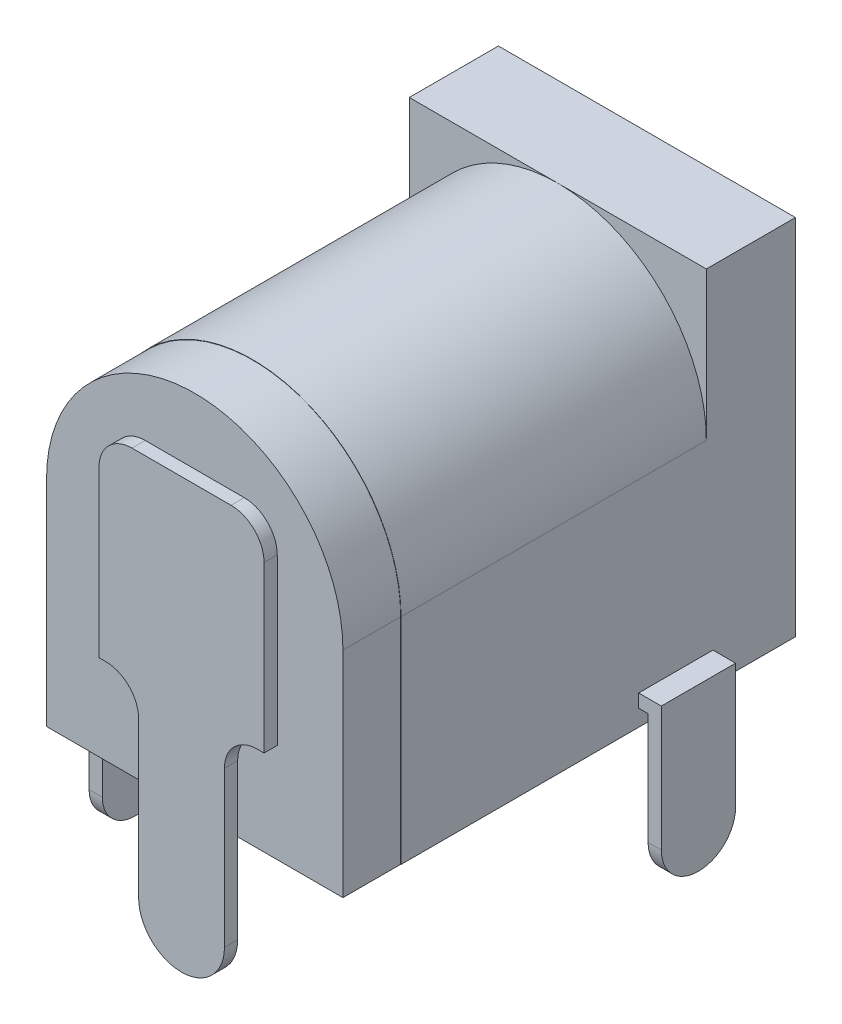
from build123d import *

# Parameters (mm, degrees)
EXTRUSION1_DEPTH        = 9.25
EXTRUSION2_DEPTH        = 1.75
ESQUISSE3_W             = 9
ESQUISSE3_H             = 11
EXTRUSION3_DEPTH        = 2.7
ESQUISSE5_R             = 3.1
ENL_V_MAT_EXTRU_1_DEPTH = 10
ESQUISSE6_R             = 1
EXTRUSION4_DEPTH        = 8
CONG_1_R                = 0.99
EXTRUSION5_DEPTH        = 0.4
ESQUISSE8_W             = 2.25
ESQUISSE8_H             = 0.4
CONG_2_R                = 1.124
ESQUISSE10_W            = 2
ESQUISSE10_H            = 0.4
CONG_3_R                = 0.99


with BuildPart() as part:
    # Esquisse1 → Extrusion1 (new body)
    with BuildSketch(Plane.XY):
        with BuildLine():
            Line((4.5, 6.5), (4.5, 0))
            Line((4.5, 0), (-4.5, 0))
            Line((-4.5, 0), (-4.5, 6.5))
            ThreePointArc((-4.5, 6.5), (0, 11), (4.5, 6.5))
        make_face()
    extrude(amount=EXTRUSION1_DEPTH)

    # Esquisse2 → Extrusion2 (add)
    with BuildSketch(Plane.XY.offset(9.25)):
        with BuildLine():
            Line((4.489996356, 6.494279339), (4.490003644, 0))
            Line((4.490003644, 0), (-4.49, 0))
            Line((-4.49, 0), (-4.49, 6.5))
            ThreePointArc((-4.49, 6.5), (0.002860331, 10.989999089), (4.489996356, 6.494279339))
        make_face()
    extrude(amount=EXTRUSION2_DEPTH)

    # Esquisse3 → Extrusion3 (add)
    with BuildSketch(Plane(origin=(0, 0, 0), x_dir=(-1, 0, 0), z_dir=(0, 0, -1))):
        with Locations((0, 5.5)):
            Rectangle(ESQUISSE3_W, ESQUISSE3_H)
    extrude(amount=EXTRUSION3_DEPTH)

    # Esquisse5 → Enl_v. mat.-Extru.1 (cut)
    with BuildSketch(Plane(origin=(0, 0, -2.7), x_dir=(-1, 0, 0), z_dir=(0, 0, -1))):
        with Locations((0, 6.5)):
            Circle(ESQUISSE5_R)
    extrude(amount=-ENL_V_MAT_EXTRU_1_DEPTH, mode=Mode.SUBTRACT)

    # Esquisse6 → Extrusion4 (add)
    with BuildSketch(Plane(origin=(0, 0, 7.3), x_dir=(-1, 0, 0), z_dir=(0, 0, -1))):
        with Locations((0, 6.5)):
            Circle(ESQUISSE6_R)
    extrude(amount=EXTRUSION4_DEPTH)

    # Cong_1
    cong_1_edges = [part.edges().sort_by_distance(p)[0] for p in [
        (1, 6.5, -0.7),
    ]]
    fillet(cong_1_edges, radius=CONG_1_R)

    # Esquisse7 → Extrusion5 (add)
    with BuildSketch(Plane.XY.offset(11)):
        with BuildLine():
            Line((1.5, 9), (-1.5, 9))
            ThreePointArc((-1.5, 9), (-2.207106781, 8.707106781), (-2.5, 8))
            Line((-2.5, 8), (-2.5, 3))
            Line((-2.5, 3), (-2.3, 3))
            ThreePointArc((-2.3, 3), (-1.592893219, 2.707106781), (-1.3, 2))
            Line((-1.3, 2), (-1.3, -2.7))
            ThreePointArc((-1.3, -2.7), (0, -4), (1.3, -2.7))
            Line((1.3, -2.7), (1.3, 2))
            ThreePointArc((1.3, 2), (1.592893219, 2.707106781), (2.3, 3))
            Line((2.3, 3), (2.5, 3))
            Line((2.5, 3), (2.5, 8))
            ThreePointArc((2.5, 8), (2.207106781, 8.707106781), (1.5, 9))
        make_face()
    extrude(amount=EXTRUSION5_DEPTH)

    # Balayage1: sweep along a path in Esquisse9
    with BuildLine(Plane.XY.offset(0.8)) as balayage1_path:
        Line((4.5, 0.714543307), (5, 0.714543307))
        Line((5, 0.714543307), (5, -4))
    # Esquisse8 → Balayage1 (sweep)
    with BuildSketch(Plane(origin=(4.5, 0, 0), x_dir=(0, 0, -1), z_dir=(1, 0, 0))):
        with Locations((-0.925, 0.7)):
            Rectangle(ESQUISSE8_W, ESQUISSE8_H)
    sweep(path=balayage1_path.line, transition=Transition.RIGHT)

    # Cong_2
    cong_2_edges = [part.edges().sort_by_distance(p)[0] for p in [
        (4.985456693, -4, -0.2),
        (4.985456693, -4, 2.05),
    ]]
    fillet(cong_2_edges, radius=CONG_2_R)

    # Balayage2: sweep along a path in Esquisse11
    with BuildLine(Plane.XY.offset(8)) as balayage2_path:
        Line((-4.5, 4.8), (-5, 4.8))
        Line((-5, 4.8), (-5, -4))
    # Esquisse10 → Balayage2 (sweep)
    with BuildSketch(Plane.ZY.offset(4.5)):
        with Locations((8, 4.8)):
            Rectangle(ESQUISSE10_W, ESQUISSE10_H)
    sweep(path=balayage2_path.line, transition=Transition.RIGHT)

    # Cong_3
    cong_3_edges = [part.edges().sort_by_distance(p)[0] for p in [
        (-5, -4, 9),
        (-5, -4, 7),
    ]]
    fillet(cong_3_edges, radius=CONG_3_R)


solid = part.part
